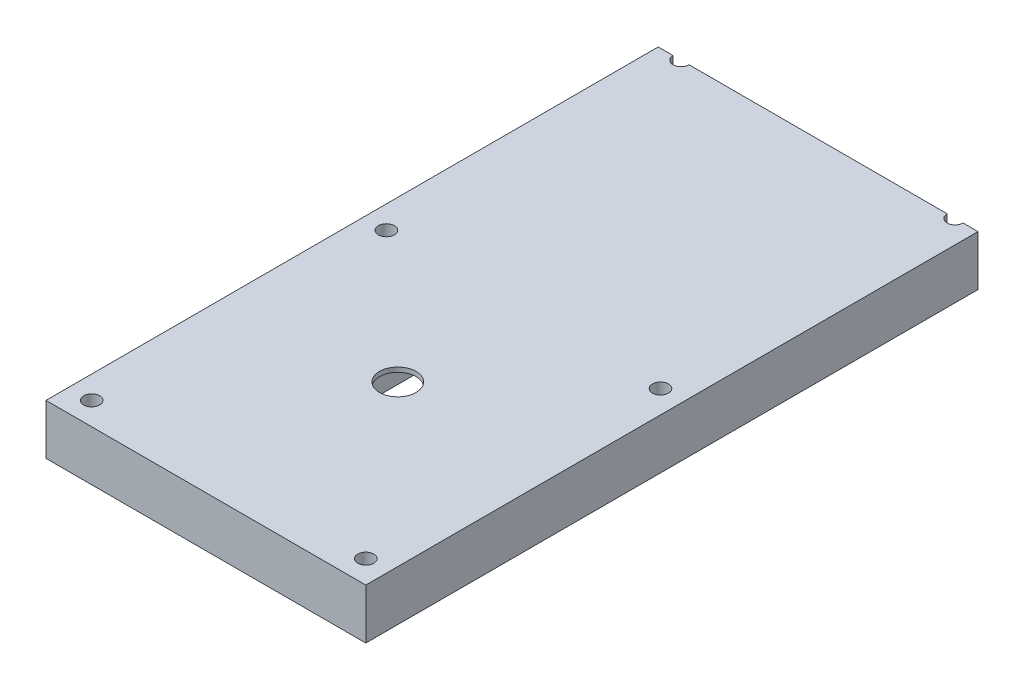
ISO-10303-21;
HEADER;
FILE_DESCRIPTION(('STEP AP214'),'2;1');
FILE_NAME('part.step','',(''),(''),'','','');
FILE_SCHEMA(('AUTOMOTIVE_DESIGN { 1 0 10303 214 1 1 1 1 }'));
ENDSEC;
DATA;
#1=APPLICATION_CONTEXT('core data for automotive mechanical design processes');
#2=APPLICATION_PROTOCOL_DEFINITION('international standard','automotive_design',2000,#1);
#3=PRODUCT_CONTEXT('',#1,'mechanical');
#4=PRODUCT('Part','Part','',(#3));
#5=PRODUCT_RELATED_PRODUCT_CATEGORY('part','',(#4));
#6=PRODUCT_DEFINITION_FORMATION('','',#4);
#7=PRODUCT_DEFINITION_CONTEXT('part definition',#1,'design');
#8=PRODUCT_DEFINITION('design','',#6,#7);
#9=PRODUCT_DEFINITION_SHAPE('','',#8);
#10=(LENGTH_UNIT() NAMED_UNIT(*) SI_UNIT(.MILLI.,.METRE.));
#11=(NAMED_UNIT(*) PLANE_ANGLE_UNIT() SI_UNIT($,.RADIAN.));
#12=(NAMED_UNIT(*) SI_UNIT($,.STERADIAN.) SOLID_ANGLE_UNIT());
#13=UNCERTAINTY_MEASURE_WITH_UNIT(LENGTH_MEASURE(1.E-05),#10,'distance_accuracy_value','');
#14=(GEOMETRIC_REPRESENTATION_CONTEXT(3) GLOBAL_UNCERTAINTY_ASSIGNED_CONTEXT((#13)) GLOBAL_UNIT_ASSIGNED_CONTEXT((#10,
#11,#12)) REPRESENTATION_CONTEXT('',''));
#15=CARTESIAN_POINT('',(0.,0.,0.));
#16=DIRECTION('',(0.,0.,1.));
#17=DIRECTION('',(1.,0.,0.));
#18=AXIS2_PLACEMENT_3D('',#15,#16,#17);
#19=CARTESIAN_POINT('',(-35.,11.,-67.));
#20=DIRECTION('',(0.,0.,1.));
#21=DIRECTION('',(1.,0.,0.));
#22=AXIS2_PLACEMENT_3D('',#19,#20,#21);
#23=PLANE('',#22);
#24=DIRECTION('',(-1.,0.,0.));
#25=VECTOR('',#24,1.);
#26=CARTESIAN_POINT('',(-35.,0.,-67.));
#27=LINE('',#26,#25);
#28=CARTESIAN_POINT('',(35.,0.,-67.));
#29=VERTEX_POINT('',#28);
#30=CARTESIAN_POINT('',(31.75,0.,-67.));
#31=VERTEX_POINT('',#30);
#32=EDGE_CURVE('E277',#29,#31,#27,.T.);
#33=ORIENTED_EDGE('',*,*,#32,.T.);
#34=DIRECTION('',(0.,1.,0.));
#35=VECTOR('',#34,1.);
#36=CARTESIAN_POINT('',(31.75,0.,-67.));
#37=LINE('',#36,#35);
#38=CARTESIAN_POINT('',(31.75,11.,-67.));
#39=VERTEX_POINT('',#38);
#40=EDGE_CURVE('E253',#31,#39,#37,.T.);
#41=ORIENTED_EDGE('',*,*,#40,.T.);
#42=DIRECTION('',(-1.,0.,0.));
#43=VECTOR('',#42,1.);
#44=CARTESIAN_POINT('',(-35.,11.,-67.));
#45=LINE('',#44,#43);
#46=CARTESIAN_POINT('',(35.,11.,-67.));
#47=VERTEX_POINT('',#46);
#48=EDGE_CURVE('E265',#47,#39,#45,.T.);
#49=ORIENTED_EDGE('',*,*,#48,.F.);
#50=DIRECTION('',(0.,-1.,0.));
#51=VECTOR('',#50,1.);
#52=CARTESIAN_POINT('',(35.,11.,-67.));
#53=LINE('',#52,#51);
#54=EDGE_CURVE('E292',#47,#29,#53,.T.);
#55=ORIENTED_EDGE('',*,*,#54,.T.);
#56=EDGE_LOOP('',(#33,#41,#49,#55));
#57=FACE_BOUND('',#56,.T.);
#58=ADVANCED_FACE('F35',(#57),#23,.F.);
#59=CARTESIAN_POINT('',(28.2499999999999,11.,-67.));
#60=VERTEX_POINT('',#59);
#61=CARTESIAN_POINT('',(-28.25,11.,-67.));
#62=VERTEX_POINT('',#61);
#63=EDGE_CURVE('E269',#60,#62,#45,.T.);
#64=ORIENTED_EDGE('',*,*,#63,.F.);
#65=DIRECTION('',(0.,1.,0.));
#66=VECTOR('',#65,1.);
#67=CARTESIAN_POINT('',(28.2499999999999,0.,-67.));
#68=LINE('',#67,#66);
#69=CARTESIAN_POINT('',(28.2499999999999,0.,-67.));
#70=VERTEX_POINT('',#69);
#71=EDGE_CURVE('E250',#60,#70,#68,.F.);
#72=ORIENTED_EDGE('',*,*,#71,.T.);
#73=CARTESIAN_POINT('',(10.25,0.,-67.));
#74=VERTEX_POINT('',#73);
#75=EDGE_CURVE('E281',#70,#74,#27,.T.);
#76=ORIENTED_EDGE('',*,*,#75,.T.);
#77=DIRECTION('',(0.,1.,0.));
#78=VECTOR('',#77,1.);
#79=CARTESIAN_POINT('',(10.25,-12.75,-67.));
#80=LINE('',#79,#78);
#81=CARTESIAN_POINT('',(10.25,-12.75,-67.));
#82=VERTEX_POINT('',#81);
#83=EDGE_CURVE('E211',#82,#74,#80,.T.);
#84=ORIENTED_EDGE('',*,*,#83,.F.);
#85=DIRECTION('',(1.,0.,0.));
#86=VECTOR('',#85,1.);
#87=CARTESIAN_POINT('',(-10.25,-12.75,-67.));
#88=LINE('',#87,#86);
#89=CARTESIAN_POINT('',(-10.25,-12.75,-67.));
#90=VERTEX_POINT('',#89);
#91=EDGE_CURVE('E194',#90,#82,#88,.T.);
#92=ORIENTED_EDGE('',*,*,#91,.F.);
#93=DIRECTION('',(0.,1.,0.));
#94=VECTOR('',#93,1.);
#95=CARTESIAN_POINT('',(-10.25,-12.75,-67.));
#96=LINE('',#95,#94);
#97=CARTESIAN_POINT('',(-10.25,0.,-67.));
#98=VERTEX_POINT('',#97);
#99=EDGE_CURVE('E214',#90,#98,#96,.T.);
#100=ORIENTED_EDGE('',*,*,#99,.T.);
#101=CARTESIAN_POINT('',(-28.25,0.,-67.));
#102=VERTEX_POINT('',#101);
#103=EDGE_CURVE('E58',#98,#102,#27,.T.);
#104=ORIENTED_EDGE('',*,*,#103,.T.);
#105=DIRECTION('',(0.,1.,0.));
#106=VECTOR('',#105,1.);
#107=CARTESIAN_POINT('',(-28.25,0.,-67.));
#108=LINE('',#107,#106);
#109=EDGE_CURVE('E247',#102,#62,#108,.T.);
#110=ORIENTED_EDGE('',*,*,#109,.T.);
#111=EDGE_LOOP('',(#64,#72,#76,#84,#92,#100,#104,#110));
#112=FACE_BOUND('',#111,.T.);
#113=ADVANCED_FACE('F313',(#112),#23,.F.);
#114=CARTESIAN_POINT('',(35.,11.,67.));
#115=DIRECTION('',(-1.,0.,0.));
#116=DIRECTION('',(0.,0.,1.));
#117=AXIS2_PLACEMENT_3D('',#114,#115,#116);
#118=PLANE('',#117);
#119=DIRECTION('',(0.,0.,-1.));
#120=VECTOR('',#119,1.);
#121=CARTESIAN_POINT('',(35.,0.,67.));
#122=LINE('',#121,#120);
#123=CARTESIAN_POINT('',(35.,0.,67.));
#124=VERTEX_POINT('',#123);
#125=EDGE_CURVE('E259',#124,#29,#122,.T.);
#126=ORIENTED_EDGE('',*,*,#125,.T.);
#127=ORIENTED_EDGE('',*,*,#54,.F.);
#128=DIRECTION('',(0.,0.,-1.));
#129=VECTOR('',#128,1.);
#130=CARTESIAN_POINT('',(35.,11.,67.));
#131=LINE('',#130,#129);
#132=CARTESIAN_POINT('',(35.,11.,67.));
#133=VERTEX_POINT('',#132);
#134=EDGE_CURVE('E260',#133,#47,#131,.T.);
#135=ORIENTED_EDGE('',*,*,#134,.F.);
#136=DIRECTION('',(0.,-1.,0.));
#137=VECTOR('',#136,1.);
#138=CARTESIAN_POINT('',(35.,11.,67.));
#139=LINE('',#138,#137);
#140=EDGE_CURVE('E273',#133,#124,#139,.T.);
#141=ORIENTED_EDGE('',*,*,#140,.T.);
#142=EDGE_LOOP('',(#126,#127,#135,#141));
#143=FACE_BOUND('',#142,.T.);
#144=ADVANCED_FACE('F37',(#143),#118,.F.);
#145=CARTESIAN_POINT('',(-31.7500000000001,11.,-67.));
#146=VERTEX_POINT('',#145);
#147=CARTESIAN_POINT('',(-35.,11.,-67.));
#148=VERTEX_POINT('',#147);
#149=EDGE_CURVE('E263',#146,#148,#45,.T.);
#150=ORIENTED_EDGE('',*,*,#149,.F.);
#151=DIRECTION('',(0.,1.,0.));
#152=VECTOR('',#151,1.);
#153=CARTESIAN_POINT('',(-31.7500000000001,0.,-67.));
#154=LINE('',#153,#152);
#155=CARTESIAN_POINT('',(-31.7500000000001,0.,-67.));
#156=VERTEX_POINT('',#155);
#157=EDGE_CURVE('E244',#146,#156,#154,.F.);
#158=ORIENTED_EDGE('',*,*,#157,.T.);
#159=CARTESIAN_POINT('',(-35.,0.,-67.));
#160=VERTEX_POINT('',#159);
#161=EDGE_CURVE('E276',#156,#160,#27,.T.);
#162=ORIENTED_EDGE('',*,*,#161,.T.);
#163=DIRECTION('',(0.,-1.,0.));
#164=VECTOR('',#163,1.);
#165=CARTESIAN_POINT('',(-35.,11.,-67.));
#166=LINE('',#165,#164);
#167=EDGE_CURVE('E289',#148,#160,#166,.T.);
#168=ORIENTED_EDGE('',*,*,#167,.F.);
#169=EDGE_LOOP('',(#150,#158,#162,#168));
#170=FACE_BOUND('',#169,.T.);
#171=ADVANCED_FACE('F302',(#170),#23,.F.);
#172=CARTESIAN_POINT('',(-35.,11.,67.));
#173=DIRECTION('',(1.,0.,0.));
#174=DIRECTION('',(0.,0.,-1.));
#175=AXIS2_PLACEMENT_3D('',#172,#173,#174);
#176=PLANE('',#175);
#177=DIRECTION('',(0.,0.,1.));
#178=VECTOR('',#177,1.);
#179=CARTESIAN_POINT('',(-35.,0.,67.));
#180=LINE('',#179,#178);
#181=CARTESIAN_POINT('',(-35.,0.,67.));
#182=VERTEX_POINT('',#181);
#183=EDGE_CURVE('E280',#160,#182,#180,.T.);
#184=ORIENTED_EDGE('',*,*,#183,.T.);
#185=DIRECTION('',(0.,-1.,0.));
#186=VECTOR('',#185,1.);
#187=CARTESIAN_POINT('',(-35.,11.,67.));
#188=LINE('',#187,#186);
#189=CARTESIAN_POINT('',(-35.,11.,67.));
#190=VERTEX_POINT('',#189);
#191=EDGE_CURVE('E286',#190,#182,#188,.T.);
#192=ORIENTED_EDGE('',*,*,#191,.F.);
#193=DIRECTION('',(0.,0.,1.));
#194=VECTOR('',#193,1.);
#195=CARTESIAN_POINT('',(-35.,11.,67.));
#196=LINE('',#195,#194);
#197=EDGE_CURVE('E268',#148,#190,#196,.T.);
#198=ORIENTED_EDGE('',*,*,#197,.F.);
#199=ORIENTED_EDGE('',*,*,#167,.T.);
#200=EDGE_LOOP('',(#184,#192,#198,#199));
#201=FACE_BOUND('',#200,.T.);
#202=ADVANCED_FACE('F346',(#201),#176,.F.);
#203=CARTESIAN_POINT('',(-35.,11.,67.));
#204=DIRECTION('',(0.,0.,-1.));
#205=DIRECTION('',(-1.,0.,0.));
#206=AXIS2_PLACEMENT_3D('',#203,#204,#205);
#207=PLANE('',#206);
#208=DIRECTION('',(1.,0.,0.));
#209=VECTOR('',#208,1.);
#210=CARTESIAN_POINT('',(-35.,0.,67.));
#211=LINE('',#210,#209);
#212=EDGE_CURVE('E264',#182,#124,#211,.T.);
#213=ORIENTED_EDGE('',*,*,#212,.T.);
#214=ORIENTED_EDGE('',*,*,#140,.F.);
#215=DIRECTION('',(1.,0.,0.));
#216=VECTOR('',#215,1.);
#217=CARTESIAN_POINT('',(-35.,11.,67.));
#218=LINE('',#217,#216);
#219=EDGE_CURVE('E271',#190,#133,#218,.T.);
#220=ORIENTED_EDGE('',*,*,#219,.F.);
#221=ORIENTED_EDGE('',*,*,#191,.T.);
#222=EDGE_LOOP('',(#213,#214,#220,#221));
#223=FACE_BOUND('',#222,.T.);
#224=ADVANCED_FACE('F351',(#223),#207,.F.);
#225=CARTESIAN_POINT('',(0.,11.,0.));
#226=DIRECTION('',(0.,-1.,0.));
#227=DIRECTION('',(0.,0.,-1.));
#228=AXIS2_PLACEMENT_3D('',#225,#226,#227);
#229=PLANE('',#228);
#230=CARTESIAN_POINT('',(29.9999999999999,11.,62.));
#231=DIRECTION('',(0.,1.,0.));
#232=DIRECTION('',(0.,0.,1.));
#233=AXIS2_PLACEMENT_3D('',#230,#231,#232);
#234=CIRCLE('',#233,1.75000000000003);
#235=CARTESIAN_POINT('',(29.9999999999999,11.,63.7500000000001));
#236=VERTEX_POINT('',#235);
#237=EDGE_CURVE('E220',#236,#236,#234,.T.);
#238=ORIENTED_EDGE('',*,*,#237,.F.);
#239=EDGE_LOOP('',(#238));
#240=FACE_BOUND('',#239,.T.);
#241=CARTESIAN_POINT('',(30.,11.,-2.49999999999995));
#242=DIRECTION('',(0.,1.,0.));
#243=DIRECTION('',(0.,0.,1.));
#244=AXIS2_PLACEMENT_3D('',#241,#242,#243);
#245=CIRCLE('',#244,1.75000000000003);
#246=CARTESIAN_POINT('',(30.,11.,-0.749999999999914));
#247=VERTEX_POINT('',#246);
#248=EDGE_CURVE('E227',#247,#247,#245,.T.);
#249=ORIENTED_EDGE('',*,*,#248,.F.);
#250=EDGE_LOOP('',(#249));
#251=FACE_BOUND('',#250,.T.);
#252=CARTESIAN_POINT('',(-30.,11.,-2.49999999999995));
#253=DIRECTION('',(0.,1.,0.));
#254=DIRECTION('',(0.,0.,1.));
#255=AXIS2_PLACEMENT_3D('',#252,#253,#254);
#256=CIRCLE('',#255,1.75000000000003);
#257=CARTESIAN_POINT('',(-30.,11.,-0.749999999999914));
#258=VERTEX_POINT('',#257);
#259=EDGE_CURVE('E226',#258,#258,#256,.T.);
#260=ORIENTED_EDGE('',*,*,#259,.F.);
#261=EDGE_LOOP('',(#260));
#262=FACE_BOUND('',#261,.T.);
#263=CARTESIAN_POINT('',(-30.0000000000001,11.,62.));
#264=DIRECTION('',(0.,1.,0.));
#265=DIRECTION('',(0.,0.,1.));
#266=AXIS2_PLACEMENT_3D('',#263,#264,#265);
#267=CIRCLE('',#266,1.75000000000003);
#268=CARTESIAN_POINT('',(-30.0000000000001,11.,63.7500000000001));
#269=VERTEX_POINT('',#268);
#270=EDGE_CURVE('E216',#269,#269,#267,.T.);
#271=ORIENTED_EDGE('',*,*,#270,.F.);
#272=EDGE_LOOP('',(#271));
#273=FACE_BOUND('',#272,.T.);
#274=CARTESIAN_POINT('',(-1.10212604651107E-13,11.,25.));
#275=DIRECTION('',(0.,1.,0.));
#276=DIRECTION('',(0.,0.,1.));
#277=AXIS2_PLACEMENT_3D('',#274,#275,#276);
#278=CIRCLE('',#277,4.);
#279=CARTESIAN_POINT('',(-1.10212604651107E-13,11.,29.));
#280=VERTEX_POINT('',#279);
#281=EDGE_CURVE('E256',#280,#280,#278,.T.);
#282=ORIENTED_EDGE('',*,*,#281,.F.);
#283=EDGE_LOOP('',(#282));
#284=FACE_BOUND('',#283,.T.);
#285=ORIENTED_EDGE('',*,*,#48,.T.);
#286=CARTESIAN_POINT('',(30.,11.,-66.9999999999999));
#287=DIRECTION('',(0.,1.,0.));
#288=DIRECTION('',(0.,0.,1.));
#289=AXIS2_PLACEMENT_3D('',#286,#287,#288);
#290=CIRCLE('',#289,1.75000000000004);
#291=EDGE_CURVE('E235',#60,#39,#290,.T.);
#292=ORIENTED_EDGE('',*,*,#291,.F.);
#293=ORIENTED_EDGE('',*,*,#63,.T.);
#294=CARTESIAN_POINT('',(-30.,11.,-66.9999999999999));
#295=DIRECTION('',(0.,1.,0.));
#296=DIRECTION('',(0.,0.,1.));
#297=AXIS2_PLACEMENT_3D('',#294,#295,#296);
#298=CIRCLE('',#297,1.75000000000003);
#299=EDGE_CURVE('E237',#146,#62,#298,.T.);
#300=ORIENTED_EDGE('',*,*,#299,.F.);
#301=ORIENTED_EDGE('',*,*,#149,.T.);
#302=ORIENTED_EDGE('',*,*,#197,.T.);
#303=ORIENTED_EDGE('',*,*,#219,.T.);
#304=ORIENTED_EDGE('',*,*,#134,.T.);
#305=EDGE_LOOP('',(#285,#292,#293,#300,#301,#302,#303,#304));
#306=FACE_BOUND('',#305,.T.);
#307=ADVANCED_FACE('F362',(#240,#251,#262,#273,#284,#306),#229,.F.);
#308=CARTESIAN_POINT('',(0.,0.,0.));
#309=DIRECTION('',(0.,-1.,0.));
#310=DIRECTION('',(0.,0.,-1.));
#311=AXIS2_PLACEMENT_3D('',#308,#309,#310);
#312=PLANE('',#311);
#313=DIRECTION('',(1.,0.,0.));
#314=VECTOR('',#313,1.);
#315=CARTESIAN_POINT('',(-10.5000000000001,0.,-63.));
#316=LINE('',#315,#314);
#317=CARTESIAN_POINT('',(-10.5000000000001,0.,-63.));
#318=VERTEX_POINT('',#317);
#319=CARTESIAN_POINT('',(-10.25,0.,-63.));
#320=VERTEX_POINT('',#319);
#321=EDGE_CURVE('E51',#318,#320,#316,.T.);
#322=ORIENTED_EDGE('',*,*,#321,.F.);
#323=DIRECTION('',(0.,0.,-1.));
#324=VECTOR('',#323,1.);
#325=CARTESIAN_POINT('',(-10.5000000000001,0.,-63.));
#326=LINE('',#325,#324);
#327=CARTESIAN_POINT('',(-10.5,0.,35.0000000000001));
#328=VERTEX_POINT('',#327);
#329=EDGE_CURVE('E156',#328,#318,#326,.T.);
#330=ORIENTED_EDGE('',*,*,#329,.F.);
#331=DIRECTION('',(-1.,0.,0.));
#332=VECTOR('',#331,1.);
#333=CARTESIAN_POINT('',(-10.5,0.,35.0000000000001));
#334=LINE('',#333,#332);
#335=CARTESIAN_POINT('',(10.5,0.,35.0000000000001));
#336=VERTEX_POINT('',#335);
#337=EDGE_CURVE('E173',#336,#328,#334,.T.);
#338=ORIENTED_EDGE('',*,*,#337,.F.);
#339=DIRECTION('',(0.,0.,1.));
#340=VECTOR('',#339,1.);
#341=CARTESIAN_POINT('',(10.5,0.,35.0000000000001));
#342=LINE('',#341,#340);
#343=CARTESIAN_POINT('',(10.4999999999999,0.,-63.));
#344=VERTEX_POINT('',#343);
#345=EDGE_CURVE('E176',#344,#336,#342,.T.);
#346=ORIENTED_EDGE('',*,*,#345,.F.);
#347=CARTESIAN_POINT('',(10.25,0.,-63.));
#348=VERTEX_POINT('',#347);
#349=EDGE_CURVE('E182',#348,#344,#316,.T.);
#350=ORIENTED_EDGE('',*,*,#349,.F.);
#351=DIRECTION('',(0.,0.,1.));
#352=VECTOR('',#351,1.);
#353=CARTESIAN_POINT('',(10.25,0.,-63.));
#354=LINE('',#353,#352);
#355=EDGE_CURVE('E195',#74,#348,#354,.T.);
#356=ORIENTED_EDGE('',*,*,#355,.F.);
#357=ORIENTED_EDGE('',*,*,#75,.F.);
#358=CARTESIAN_POINT('',(30.,0.,-66.9999999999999));
#359=DIRECTION('',(0.,-1.,0.));
#360=DIRECTION('',(0.,0.,-1.));
#361=AXIS2_PLACEMENT_3D('',#358,#359,#360);
#362=CIRCLE('',#361,1.75000000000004);
#363=EDGE_CURVE('E11',#31,#70,#362,.T.);
#364=ORIENTED_EDGE('',*,*,#363,.F.);
#365=ORIENTED_EDGE('',*,*,#32,.F.);
#366=ORIENTED_EDGE('',*,*,#125,.F.);
#367=ORIENTED_EDGE('',*,*,#212,.F.);
#368=ORIENTED_EDGE('',*,*,#183,.F.);
#369=ORIENTED_EDGE('',*,*,#161,.F.);
#370=CARTESIAN_POINT('',(-30.,0.,-66.9999999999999));
#371=DIRECTION('',(0.,-1.,0.));
#372=DIRECTION('',(0.,0.,-1.));
#373=AXIS2_PLACEMENT_3D('',#370,#371,#372);
#374=CIRCLE('',#373,1.75000000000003);
#375=EDGE_CURVE('E44',#102,#156,#374,.T.);
#376=ORIENTED_EDGE('',*,*,#375,.F.);
#377=ORIENTED_EDGE('',*,*,#103,.F.);
#378=DIRECTION('',(0.,0.,-1.));
#379=VECTOR('',#378,1.);
#380=CARTESIAN_POINT('',(-10.25,0.,-63.));
#381=LINE('',#380,#379);
#382=EDGE_CURVE('E202',#320,#98,#381,.T.);
#383=ORIENTED_EDGE('',*,*,#382,.F.);
#384=EDGE_LOOP('',(#322,#330,#338,#346,#350,#356,#357,#364,#365,#366,#367,#368,#369,#376,#377,#383));
#385=FACE_BOUND('',#384,.T.);
#386=CARTESIAN_POINT('',(29.9999999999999,0.,62.));
#387=DIRECTION('',(0.,1.,0.));
#388=DIRECTION('',(0.,0.,1.));
#389=AXIS2_PLACEMENT_3D('',#386,#387,#388);
#390=CIRCLE('',#389,1.75000000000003);
#391=CARTESIAN_POINT('',(29.9999999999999,0.,63.7500000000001));
#392=VERTEX_POINT('',#391);
#393=EDGE_CURVE('E230',#392,#392,#390,.T.);
#394=ORIENTED_EDGE('',*,*,#393,.T.);
#395=EDGE_LOOP('',(#394));
#396=FACE_BOUND('',#395,.T.);
#397=CARTESIAN_POINT('',(30.,0.,-2.49999999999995));
#398=DIRECTION('',(0.,1.,0.));
#399=DIRECTION('',(0.,0.,1.));
#400=AXIS2_PLACEMENT_3D('',#397,#398,#399);
#401=CIRCLE('',#400,1.75000000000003);
#402=CARTESIAN_POINT('',(30.,0.,-0.749999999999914));
#403=VERTEX_POINT('',#402);
#404=EDGE_CURVE('E223',#403,#403,#401,.T.);
#405=ORIENTED_EDGE('',*,*,#404,.T.);
#406=EDGE_LOOP('',(#405));
#407=FACE_BOUND('',#406,.T.);
#408=CARTESIAN_POINT('',(-30.,0.,-2.49999999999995));
#409=DIRECTION('',(0.,1.,0.));
#410=DIRECTION('',(0.,0.,1.));
#411=AXIS2_PLACEMENT_3D('',#408,#409,#410);
#412=CIRCLE('',#411,1.75000000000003);
#413=CARTESIAN_POINT('',(-30.,0.,-0.749999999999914));
#414=VERTEX_POINT('',#413);
#415=EDGE_CURVE('E238',#414,#414,#412,.T.);
#416=ORIENTED_EDGE('',*,*,#415,.T.);
#417=EDGE_LOOP('',(#416));
#418=FACE_BOUND('',#417,.T.);
#419=CARTESIAN_POINT('',(-30.0000000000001,0.,62.));
#420=DIRECTION('',(0.,1.,0.));
#421=DIRECTION('',(0.,0.,1.));
#422=AXIS2_PLACEMENT_3D('',#419,#420,#421);
#423=CIRCLE('',#422,1.75000000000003);
#424=CARTESIAN_POINT('',(-30.0000000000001,0.,63.7500000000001));
#425=VERTEX_POINT('',#424);
#426=EDGE_CURVE('E217',#425,#425,#423,.T.);
#427=ORIENTED_EDGE('',*,*,#426,.T.);
#428=EDGE_LOOP('',(#427));
#429=FACE_BOUND('',#428,.T.);
#430=ADVANCED_FACE('F305',(#385,#396,#407,#418,#429),#312,.T.);
#431=CARTESIAN_POINT('',(-1.10212604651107E-13,0.999999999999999,25.));
#432=DIRECTION('',(0.,1.,0.));
#433=DIRECTION('',(0.,0.,1.));
#434=AXIS2_PLACEMENT_3D('',#431,#432,#433);
#435=CYLINDRICAL_SURFACE('',#434,4.);
#436=CARTESIAN_POINT('',(-1.10212604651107E-13,10.,25.));
#437=DIRECTION('',(0.,1.,0.));
#438=DIRECTION('',(0.,0.,1.));
#439=AXIS2_PLACEMENT_3D('',#436,#437,#438);
#440=CIRCLE('',#439,4.);
#441=CARTESIAN_POINT('',(-1.10212604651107E-13,10.,29.));
#442=VERTEX_POINT('',#441);
#443=EDGE_CURVE('E39',#442,#442,#440,.F.);
#444=ORIENTED_EDGE('',*,*,#443,.T.);
#445=EDGE_LOOP('',(#444));
#446=FACE_BOUND('',#445,.T.);
#447=ORIENTED_EDGE('',*,*,#281,.T.);
#448=EDGE_LOOP('',(#447));
#449=FACE_BOUND('',#448,.T.);
#450=ADVANCED_FACE('F376',(#446,#449),#435,.F.);
#451=CARTESIAN_POINT('',(-30.,0.,-66.9999999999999));
#452=DIRECTION('',(0.,1.,0.));
#453=DIRECTION('',(0.,0.,1.));
#454=AXIS2_PLACEMENT_3D('',#451,#452,#453);
#455=CYLINDRICAL_SURFACE('',#454,1.75000000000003);
#456=ORIENTED_EDGE('',*,*,#375,.T.);
#457=ORIENTED_EDGE('',*,*,#157,.F.);
#458=ORIENTED_EDGE('',*,*,#299,.T.);
#459=ORIENTED_EDGE('',*,*,#109,.F.);
#460=EDGE_LOOP('',(#456,#457,#458,#459));
#461=FACE_BOUND('',#460,.T.);
#462=ADVANCED_FACE('F297',(#461),#455,.F.);
#463=CARTESIAN_POINT('',(-30.0000000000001,0.,62.));
#464=DIRECTION('',(0.,1.,0.));
#465=DIRECTION('',(0.,0.,1.));
#466=AXIS2_PLACEMENT_3D('',#463,#464,#465);
#467=CYLINDRICAL_SURFACE('',#466,1.75000000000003);
#468=ORIENTED_EDGE('',*,*,#426,.F.);
#469=EDGE_LOOP('',(#468));
#470=FACE_BOUND('',#469,.T.);
#471=ORIENTED_EDGE('',*,*,#270,.T.);
#472=EDGE_LOOP('',(#471));
#473=FACE_BOUND('',#472,.T.);
#474=ADVANCED_FACE('F383',(#470,#473),#467,.F.);
#475=CARTESIAN_POINT('',(30.,0.,-66.9999999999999));
#476=DIRECTION('',(0.,1.,0.));
#477=DIRECTION('',(0.,0.,1.));
#478=AXIS2_PLACEMENT_3D('',#475,#476,#477);
#479=CYLINDRICAL_SURFACE('',#478,1.75000000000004);
#480=ORIENTED_EDGE('',*,*,#363,.T.);
#481=ORIENTED_EDGE('',*,*,#71,.F.);
#482=ORIENTED_EDGE('',*,*,#291,.T.);
#483=ORIENTED_EDGE('',*,*,#40,.F.);
#484=EDGE_LOOP('',(#480,#481,#482,#483));
#485=FACE_BOUND('',#484,.T.);
#486=ADVANCED_FACE('F388',(#485),#479,.F.);
#487=CARTESIAN_POINT('',(-30.,0.,-2.49999999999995));
#488=DIRECTION('',(0.,1.,0.));
#489=DIRECTION('',(0.,0.,1.));
#490=AXIS2_PLACEMENT_3D('',#487,#488,#489);
#491=CYLINDRICAL_SURFACE('',#490,1.75000000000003);
#492=ORIENTED_EDGE('',*,*,#415,.F.);
#493=EDGE_LOOP('',(#492));
#494=FACE_BOUND('',#493,.T.);
#495=ORIENTED_EDGE('',*,*,#259,.T.);
#496=EDGE_LOOP('',(#495));
#497=FACE_BOUND('',#496,.T.);
#498=ADVANCED_FACE('F384',(#494,#497),#491,.F.);
#499=CARTESIAN_POINT('',(30.,0.,-2.49999999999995));
#500=DIRECTION('',(0.,1.,0.));
#501=DIRECTION('',(0.,0.,1.));
#502=AXIS2_PLACEMENT_3D('',#499,#500,#501);
#503=CYLINDRICAL_SURFACE('',#502,1.75000000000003);
#504=ORIENTED_EDGE('',*,*,#404,.F.);
#505=EDGE_LOOP('',(#504));
#506=FACE_BOUND('',#505,.T.);
#507=ORIENTED_EDGE('',*,*,#248,.T.);
#508=EDGE_LOOP('',(#507));
#509=FACE_BOUND('',#508,.T.);
#510=ADVANCED_FACE('F387',(#506,#509),#503,.F.);
#511=CARTESIAN_POINT('',(29.9999999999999,0.,62.));
#512=DIRECTION('',(0.,1.,0.));
#513=DIRECTION('',(0.,0.,1.));
#514=AXIS2_PLACEMENT_3D('',#511,#512,#513);
#515=CYLINDRICAL_SURFACE('',#514,1.75000000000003);
#516=ORIENTED_EDGE('',*,*,#393,.F.);
#517=EDGE_LOOP('',(#516));
#518=FACE_BOUND('',#517,.T.);
#519=ORIENTED_EDGE('',*,*,#237,.T.);
#520=EDGE_LOOP('',(#519));
#521=FACE_BOUND('',#520,.T.);
#522=ADVANCED_FACE('F393',(#518,#521),#515,.F.);
#523=CARTESIAN_POINT('',(-10.25,-12.75,-63.));
#524=DIRECTION('',(1.,0.,0.));
#525=DIRECTION('',(0.,0.,-1.));
#526=AXIS2_PLACEMENT_3D('',#523,#524,#525);
#527=PLANE('',#526);
#528=ORIENTED_EDGE('',*,*,#382,.T.);
#529=ORIENTED_EDGE('',*,*,#99,.F.);
#530=DIRECTION('',(0.,0.,-1.));
#531=VECTOR('',#530,1.);
#532=CARTESIAN_POINT('',(-10.25,-12.75,-63.));
#533=LINE('',#532,#531);
#534=CARTESIAN_POINT('',(-10.25,-12.75,-63.));
#535=VERTEX_POINT('',#534);
#536=EDGE_CURVE('E191',#535,#90,#533,.T.);
#537=ORIENTED_EDGE('',*,*,#536,.F.);
#538=DIRECTION('',(0.,1.,0.));
#539=VECTOR('',#538,1.);
#540=CARTESIAN_POINT('',(-10.25,-12.75,-63.));
#541=LINE('',#540,#539);
#542=EDGE_CURVE('E201',#535,#320,#541,.T.);
#543=ORIENTED_EDGE('',*,*,#542,.T.);
#544=EDGE_LOOP('',(#528,#529,#537,#543));
#545=FACE_BOUND('',#544,.T.);
#546=ADVANCED_FACE('F325',(#545),#527,.F.);
#547=CARTESIAN_POINT('',(10.25,-12.75,-63.));
#548=DIRECTION('',(-1.,0.,0.));
#549=DIRECTION('',(0.,0.,1.));
#550=AXIS2_PLACEMENT_3D('',#547,#548,#549);
#551=PLANE('',#550);
#552=ORIENTED_EDGE('',*,*,#355,.T.);
#553=DIRECTION('',(0.,1.,0.));
#554=VECTOR('',#553,1.);
#555=CARTESIAN_POINT('',(10.25,-12.75,-63.));
#556=LINE('',#555,#554);
#557=CARTESIAN_POINT('',(10.25,-12.75,-63.));
#558=VERTEX_POINT('',#557);
#559=EDGE_CURVE('E209',#558,#348,#556,.T.);
#560=ORIENTED_EDGE('',*,*,#559,.F.);
#561=DIRECTION('',(0.,0.,1.));
#562=VECTOR('',#561,1.);
#563=CARTESIAN_POINT('',(10.25,-12.75,-63.));
#564=LINE('',#563,#562);
#565=EDGE_CURVE('E197',#82,#558,#564,.T.);
#566=ORIENTED_EDGE('',*,*,#565,.F.);
#567=ORIENTED_EDGE('',*,*,#83,.T.);
#568=EDGE_LOOP('',(#552,#560,#566,#567));
#569=FACE_BOUND('',#568,.T.);
#570=ADVANCED_FACE('F317',(#569),#551,.F.);
#571=CARTESIAN_POINT('',(-10.25,-12.75,-63.));
#572=DIRECTION('',(0.,0.,-1.));
#573=DIRECTION('',(-1.,0.,0.));
#574=AXIS2_PLACEMENT_3D('',#571,#572,#573);
#575=PLANE('',#574);
#576=ORIENTED_EDGE('',*,*,#559,.T.);
#577=ORIENTED_EDGE('',*,*,#349,.T.);
#578=DIRECTION('',(0.,-1.,0.));
#579=VECTOR('',#578,1.);
#580=CARTESIAN_POINT('',(10.4999999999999,10.,-63.));
#581=LINE('',#580,#579);
#582=CARTESIAN_POINT('',(10.4999999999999,10.,-63.));
#583=VERTEX_POINT('',#582);
#584=EDGE_CURVE('E157',#583,#344,#581,.T.);
#585=ORIENTED_EDGE('',*,*,#584,.F.);
#586=DIRECTION('',(1.,0.,0.));
#587=VECTOR('',#586,1.);
#588=CARTESIAN_POINT('',(-10.5000000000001,10.,-63.));
#589=LINE('',#588,#587);
#590=CARTESIAN_POINT('',(-10.5000000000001,10.,-63.));
#591=VERTEX_POINT('',#590);
#592=EDGE_CURVE('E161',#591,#583,#589,.T.);
#593=ORIENTED_EDGE('',*,*,#592,.F.);
#594=DIRECTION('',(0.,-1.,0.));
#595=VECTOR('',#594,1.);
#596=CARTESIAN_POINT('',(-10.5000000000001,10.,-63.));
#597=LINE('',#596,#595);
#598=EDGE_CURVE('E149',#591,#318,#597,.T.);
#599=ORIENTED_EDGE('',*,*,#598,.T.);
#600=ORIENTED_EDGE('',*,*,#321,.T.);
#601=ORIENTED_EDGE('',*,*,#542,.F.);
#602=DIRECTION('',(-1.,0.,0.));
#603=VECTOR('',#602,1.);
#604=CARTESIAN_POINT('',(-10.25,-12.75,-63.));
#605=LINE('',#604,#603);
#606=EDGE_CURVE('E199',#558,#535,#605,.T.);
#607=ORIENTED_EDGE('',*,*,#606,.F.);
#608=EDGE_LOOP('',(#576,#577,#585,#593,#599,#600,#601,#607));
#609=FACE_BOUND('',#608,.T.);
#610=ADVANCED_FACE('F163',(#609),#575,.F.);
#611=CARTESIAN_POINT('',(0.,-12.75,0.));
#612=DIRECTION('',(0.,-1.,0.));
#613=DIRECTION('',(0.,0.,-1.));
#614=AXIS2_PLACEMENT_3D('',#611,#612,#613);
#615=PLANE('',#614);
#616=ORIENTED_EDGE('',*,*,#536,.T.);
#617=ORIENTED_EDGE('',*,*,#91,.T.);
#618=ORIENTED_EDGE('',*,*,#565,.T.);
#619=ORIENTED_EDGE('',*,*,#606,.T.);
#620=EDGE_LOOP('',(#616,#617,#618,#619));
#621=FACE_BOUND('',#620,.T.);
#622=ADVANCED_FACE('F321',(#621),#615,.T.);
#623=CARTESIAN_POINT('',(0.,10.,0.));
#624=DIRECTION('',(0.,1.,0.));
#625=DIRECTION('',(0.,0.,1.));
#626=AXIS2_PLACEMENT_3D('',#623,#624,#625);
#627=PLANE('',#626);
#628=DIRECTION('',(0.,0.,-1.));
#629=VECTOR('',#628,1.);
#630=CARTESIAN_POINT('',(-10.5000000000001,10.,-63.));
#631=LINE('',#630,#629);
#632=CARTESIAN_POINT('',(-10.5,10.,35.0000000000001));
#633=VERTEX_POINT('',#632);
#634=EDGE_CURVE('E153',#633,#591,#631,.T.);
#635=ORIENTED_EDGE('',*,*,#634,.T.);
#636=ORIENTED_EDGE('',*,*,#592,.T.);
#637=DIRECTION('',(0.,0.,1.));
#638=VECTOR('',#637,1.);
#639=CARTESIAN_POINT('',(10.5,10.,35.0000000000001));
#640=LINE('',#639,#638);
#641=CARTESIAN_POINT('',(10.5,10.,35.0000000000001));
#642=VERTEX_POINT('',#641);
#643=EDGE_CURVE('E168',#583,#642,#640,.T.);
#644=ORIENTED_EDGE('',*,*,#643,.T.);
#645=DIRECTION('',(-1.,0.,0.));
#646=VECTOR('',#645,1.);
#647=CARTESIAN_POINT('',(-10.5,10.,35.0000000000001));
#648=LINE('',#647,#646);
#649=EDGE_CURVE('E158',#642,#633,#648,.T.);
#650=ORIENTED_EDGE('',*,*,#649,.T.);
#651=EDGE_LOOP('',(#635,#636,#644,#650));
#652=FACE_BOUND('',#651,.T.);
#653=ORIENTED_EDGE('',*,*,#443,.F.);
#654=EDGE_LOOP('',(#653));
#655=FACE_BOUND('',#654,.T.);
#656=ADVANCED_FACE('F170',(#652,#655),#627,.F.);
#657=CARTESIAN_POINT('',(-10.5000000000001,10.,-63.));
#658=DIRECTION('',(-1.,0.,0.));
#659=DIRECTION('',(0.,0.,1.));
#660=AXIS2_PLACEMENT_3D('',#657,#658,#659);
#661=PLANE('',#660);
#662=ORIENTED_EDGE('',*,*,#329,.T.);
#663=ORIENTED_EDGE('',*,*,#598,.F.);
#664=ORIENTED_EDGE('',*,*,#634,.F.);
#665=DIRECTION('',(0.,-1.,0.));
#666=VECTOR('',#665,1.);
#667=CARTESIAN_POINT('',(-10.5,10.,35.0000000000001));
#668=LINE('',#667,#666);
#669=EDGE_CURVE('E186',#633,#328,#668,.T.);
#670=ORIENTED_EDGE('',*,*,#669,.T.);
#671=EDGE_LOOP('',(#662,#663,#664,#670));
#672=FACE_BOUND('',#671,.T.);
#673=ADVANCED_FACE('F151',(#672),#661,.F.);
#674=CARTESIAN_POINT('',(-10.5,10.,35.0000000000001));
#675=DIRECTION('',(0.,0.,1.));
#676=DIRECTION('',(1.,0.,0.));
#677=AXIS2_PLACEMENT_3D('',#674,#675,#676);
#678=PLANE('',#677);
#679=ORIENTED_EDGE('',*,*,#337,.T.);
#680=ORIENTED_EDGE('',*,*,#669,.F.);
#681=ORIENTED_EDGE('',*,*,#649,.F.);
#682=DIRECTION('',(0.,-1.,0.));
#683=VECTOR('',#682,1.);
#684=CARTESIAN_POINT('',(10.5,10.,35.0000000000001));
#685=LINE('',#684,#683);
#686=EDGE_CURVE('E188',#642,#336,#685,.T.);
#687=ORIENTED_EDGE('',*,*,#686,.T.);
#688=EDGE_LOOP('',(#679,#680,#681,#687));
#689=FACE_BOUND('',#688,.T.);
#690=ADVANCED_FACE('F329',(#689),#678,.F.);
#691=CARTESIAN_POINT('',(10.5,10.,35.0000000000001));
#692=DIRECTION('',(1.,0.,0.));
#693=DIRECTION('',(0.,0.,-1.));
#694=AXIS2_PLACEMENT_3D('',#691,#692,#693);
#695=PLANE('',#694);
#696=ORIENTED_EDGE('',*,*,#345,.T.);
#697=ORIENTED_EDGE('',*,*,#686,.F.);
#698=ORIENTED_EDGE('',*,*,#643,.F.);
#699=ORIENTED_EDGE('',*,*,#584,.T.);
#700=EDGE_LOOP('',(#696,#697,#698,#699));
#701=FACE_BOUND('',#700,.T.);
#702=ADVANCED_FACE('F331',(#701),#695,.F.);
#703=CLOSED_SHELL('',(#58,#113,#144,#171,#202,#224,#307,#430,#450,#462,#474,#486,#498,#510,#522,
#546,#570,#610,#622,#656,#673,#690,#702));
#704=MANIFOLD_SOLID_BREP('B2',#703);
#705=ADVANCED_BREP_SHAPE_REPRESENTATION('',(#18,#704),#14);
#706=SHAPE_DEFINITION_REPRESENTATION(#9,#705);
ENDSEC;
END-ISO-10303-21;
